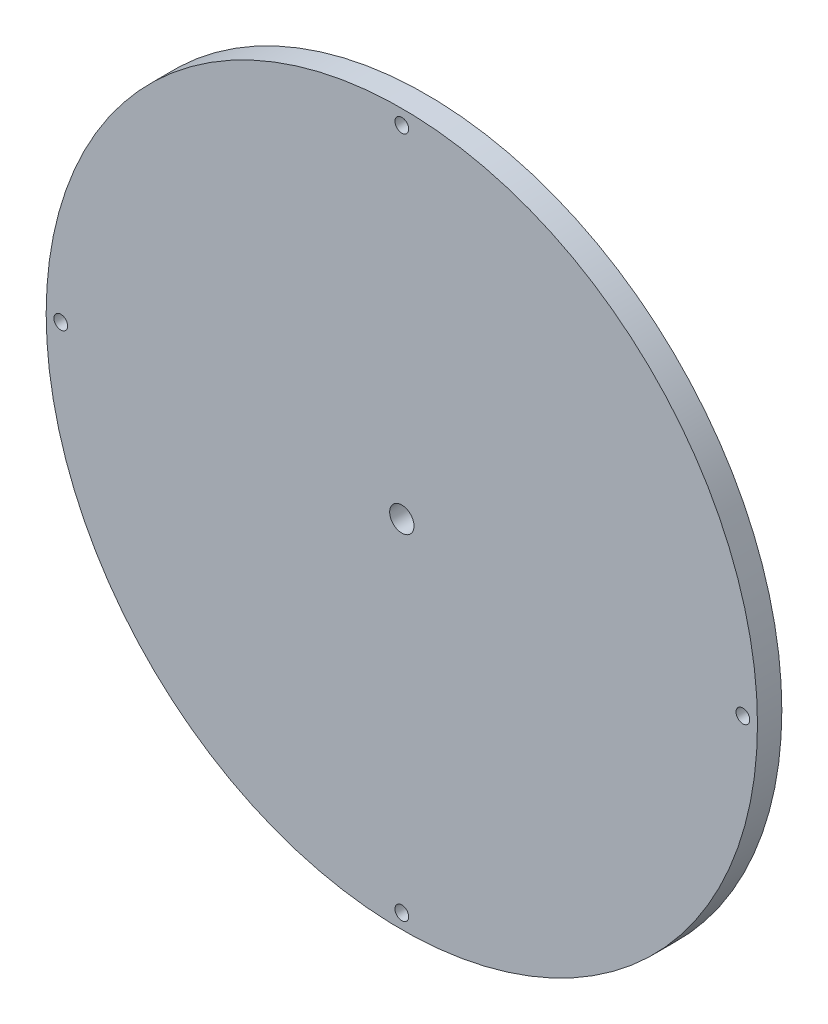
from build123d import *

# Parameters (mm, degrees)
SKETCH1_R           = 92.71
SKETCH1_R_2         = 3.175
SKETCH1_R_3         = 1.7859375
BOSS_EXTRUDE1_DEPTH = 6.35


with BuildPart() as part:
    # Sketch1 → Boss-Extrude1 (new body)
    with BuildSketch(Plane.XY):
        Circle(SKETCH1_R)
        Circle(SKETCH1_R_2, mode=Mode.SUBTRACT)
        with Locations((0, 88.9)):
            Circle(SKETCH1_R_3, mode=Mode.SUBTRACT)
        with Locations((88.9, 0)):
            Circle(SKETCH1_R_3, mode=Mode.SUBTRACT)
        with Locations((0, -88.9)):
            Circle(SKETCH1_R_3, mode=Mode.SUBTRACT)
        with Locations((-88.9, 0)):
            Circle(SKETCH1_R_3, mode=Mode.SUBTRACT)
    extrude(amount=BOSS_EXTRUDE1_DEPTH)


solid = part.part
